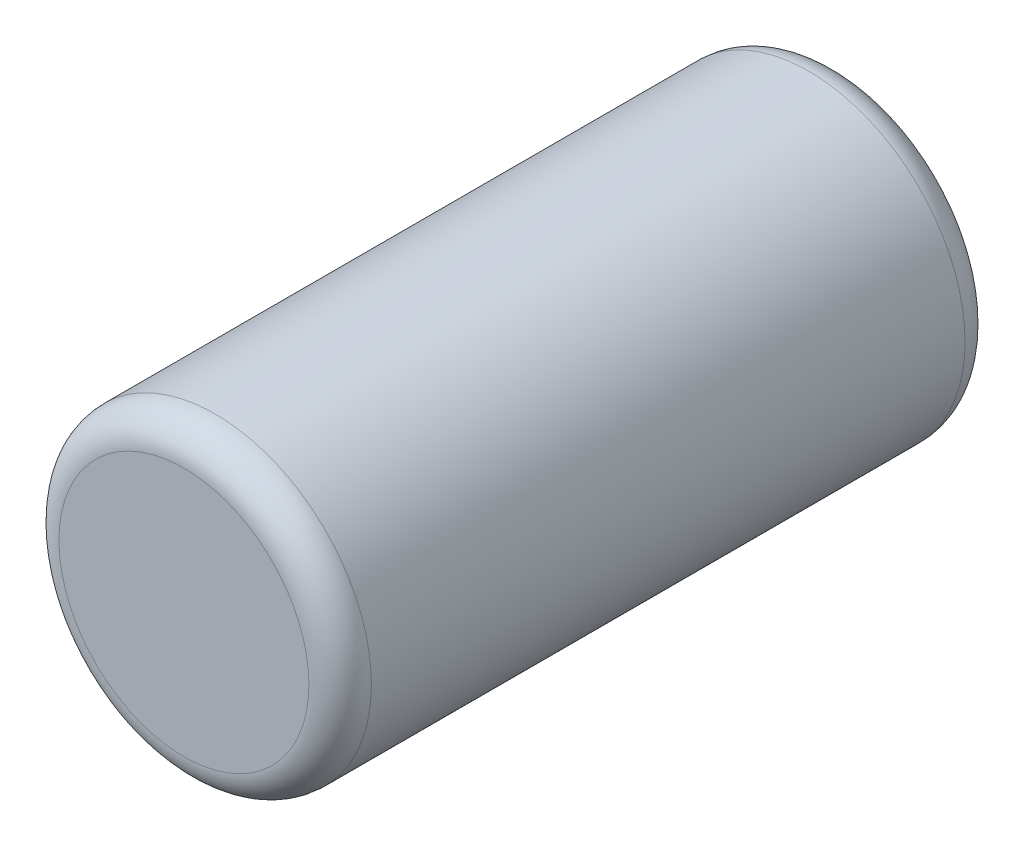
from build123d import *

# Parameters (mm, degrees)
ESQUISSE1_R          = 5
BASE_EXTRUSION_DEPTH = 10.5
CONG_1_R             = 1


with BuildPart() as part:
    # Esquisse1 → Base-Extrusion (new, symmetric)
    with BuildSketch(Plane.XY):
        with Locations(Location((0, 0, 0), (0, 0, 180))):
            Circle(ESQUISSE1_R)
    extrude(amount=BASE_EXTRUSION_DEPTH, both=True)

    # Cong_1
    cong_1_edges = [part.edges().sort_by_distance(p)[0] for p in [
        (5, 0, -10.5),
        (5, 0, 10.5),
    ]]
    fillet(cong_1_edges, radius=CONG_1_R)


solid = part.part
